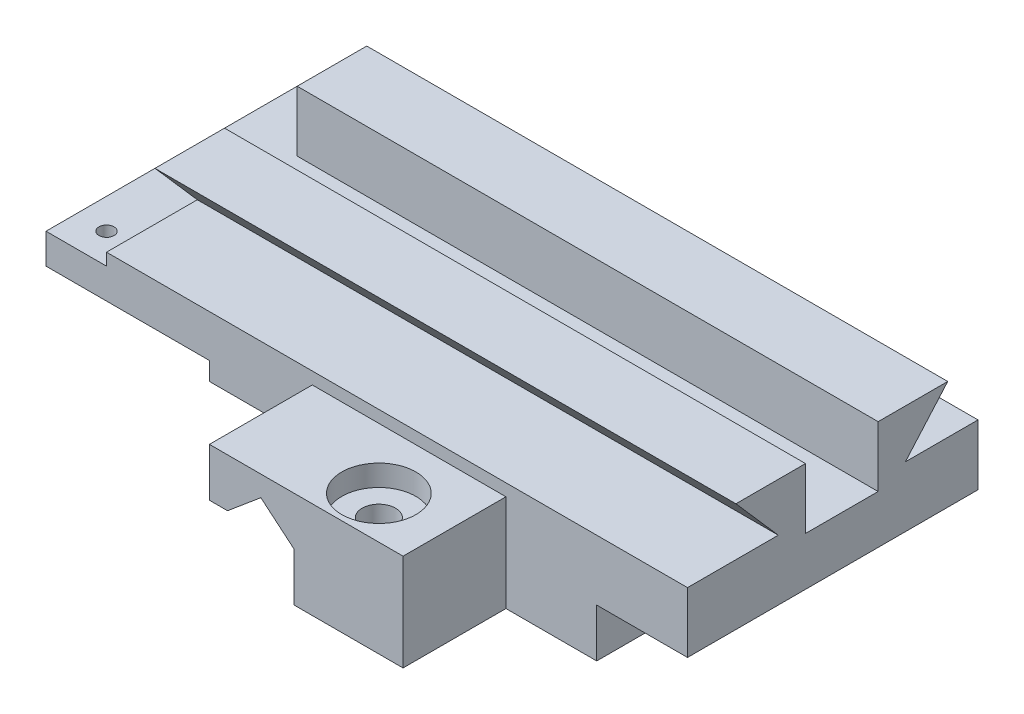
ISO-10303-21;
HEADER;
FILE_DESCRIPTION(('STEP AP214'),'2;1');
FILE_NAME('part.step','',(''),(''),'','','');
FILE_SCHEMA(('AUTOMOTIVE_DESIGN { 1 0 10303 214 1 1 1 1 }'));
ENDSEC;
DATA;
#1=APPLICATION_CONTEXT('core data for automotive mechanical design processes');
#2=APPLICATION_PROTOCOL_DEFINITION('international standard','automotive_design',2000,#1);
#3=PRODUCT_CONTEXT('',#1,'mechanical');
#4=PRODUCT('Part','Part','',(#3));
#5=PRODUCT_RELATED_PRODUCT_CATEGORY('part','',(#4));
#6=PRODUCT_DEFINITION_FORMATION('','',#4);
#7=PRODUCT_DEFINITION_CONTEXT('part definition',#1,'design');
#8=PRODUCT_DEFINITION('design','',#6,#7);
#9=PRODUCT_DEFINITION_SHAPE('','',#8);
#10=(LENGTH_UNIT() NAMED_UNIT(*) SI_UNIT(.MILLI.,.METRE.));
#11=(NAMED_UNIT(*) PLANE_ANGLE_UNIT() SI_UNIT($,.RADIAN.));
#12=(NAMED_UNIT(*) SI_UNIT($,.STERADIAN.) SOLID_ANGLE_UNIT());
#13=UNCERTAINTY_MEASURE_WITH_UNIT(LENGTH_MEASURE(1.E-05),#10,'distance_accuracy_value','');
#14=(GEOMETRIC_REPRESENTATION_CONTEXT(3) GLOBAL_UNCERTAINTY_ASSIGNED_CONTEXT((#13)) GLOBAL_UNIT_ASSIGNED_CONTEXT((#10,
#11,#12)) REPRESENTATION_CONTEXT('',''));
#15=CARTESIAN_POINT('',(0.,0.,0.));
#16=DIRECTION('',(0.,0.,1.));
#17=DIRECTION('',(1.,0.,0.));
#18=AXIS2_PLACEMENT_3D('',#15,#16,#17);
#19=CARTESIAN_POINT('',(10.,5.,65.));
#20=DIRECTION('',(1.,0.,0.));
#21=DIRECTION('',(0.,0.,-1.));
#22=AXIS2_PLACEMENT_3D('',#19,#20,#21);
#23=PLANE('',#22);
#24=DIRECTION('',(0.,1.,0.));
#25=VECTOR('',#24,1.);
#26=CARTESIAN_POINT('',(9.99999999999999,7.00000000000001,28.5));
#27=LINE('',#26,#25);
#28=CARTESIAN_POINT('',(10.,5.,28.5));
#29=VERTEX_POINT('',#28);
#30=CARTESIAN_POINT('',(9.99999999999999,15.,28.5));
#31=VERTEX_POINT('',#30);
#32=EDGE_CURVE('E274',#29,#31,#27,.T.);
#33=ORIENTED_EDGE('',*,*,#32,.F.);
#34=DIRECTION('',(0.,0.,-1.));
#35=VECTOR('',#34,1.);
#36=CARTESIAN_POINT('',(10.,5.,65.));
#37=LINE('',#36,#35);
#38=CARTESIAN_POINT('',(10.,5.,48.));
#39=VERTEX_POINT('',#38);
#40=EDGE_CURVE('E421',#39,#29,#37,.T.);
#41=ORIENTED_EDGE('',*,*,#40,.F.);
#42=DIRECTION('',(0.,1.,0.));
#43=VECTOR('',#42,1.);
#44=CARTESIAN_POINT('',(10.,5.,48.));
#45=LINE('',#44,#43);
#46=CARTESIAN_POINT('',(10.,7.,48.));
#47=VERTEX_POINT('',#46);
#48=EDGE_CURVE('E351',#39,#47,#45,.T.);
#49=ORIENTED_EDGE('',*,*,#48,.T.);
#50=DIRECTION('',(0.,0.,-1.));
#51=VECTOR('',#50,1.);
#52=CARTESIAN_POINT('',(10.,7.,65.));
#53=LINE('',#52,#51);
#54=CARTESIAN_POINT('',(9.99999999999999,7.00000000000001,33.));
#55=VERTEX_POINT('',#54);
#56=EDGE_CURVE('E425',#47,#55,#53,.T.);
#57=ORIENTED_EDGE('',*,*,#56,.T.);
#58=DIRECTION('',(0.,-0.752576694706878,-0.658504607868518));
#59=VECTOR('',#58,1.);
#60=CARTESIAN_POINT('',(9.99999999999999,15.,40.));
#61=LINE('',#60,#59);
#62=CARTESIAN_POINT('',(9.99999999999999,15.,40.));
#63=VERTEX_POINT('',#62);
#64=EDGE_CURVE('E281',#63,#55,#61,.T.);
#65=ORIENTED_EDGE('',*,*,#64,.F.);
#66=DIRECTION('',(0.,0.,1.));
#67=VECTOR('',#66,1.);
#68=CARTESIAN_POINT('',(9.99999999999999,15.,28.5));
#69=LINE('',#68,#67);
#70=EDGE_CURVE('E277',#31,#63,#69,.T.);
#71=ORIENTED_EDGE('',*,*,#70,.F.);
#72=EDGE_LOOP('',(#33,#41,#49,#57,#65,#71));
#73=FACE_BOUND('',#72,.T.);
#74=ADVANCED_FACE('F41',(#73),#23,.F.);
#75=CARTESIAN_POINT('',(106.,7.00000000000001,65.));
#76=DIRECTION('',(0.,-1.,0.));
#77=DIRECTION('',(1.,0.,0.));
#78=AXIS2_PLACEMENT_3D('',#75,#76,#77);
#79=PLANE('',#78);
#80=DIRECTION('',(1.,0.,0.));
#81=VECTOR('',#80,1.);
#82=CARTESIAN_POINT('',(9.99999999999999,7.00000000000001,33.));
#83=LINE('',#82,#81);
#84=CARTESIAN_POINT('',(106.,7.00000000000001,33.));
#85=VERTEX_POINT('',#84);
#86=EDGE_CURVE('E291',#55,#85,#83,.T.);
#87=ORIENTED_EDGE('',*,*,#86,.F.);
#88=ORIENTED_EDGE('',*,*,#56,.F.);
#89=DIRECTION('',(-1.,0.,0.));
#90=VECTOR('',#89,1.);
#91=CARTESIAN_POINT('',(44.,7.,48.));
#92=LINE('',#91,#90);
#93=CARTESIAN_POINT('',(106.,7.00000000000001,48.));
#94=VERTEX_POINT('',#93);
#95=EDGE_CURVE('E328',#94,#47,#92,.T.);
#96=ORIENTED_EDGE('',*,*,#95,.F.);
#97=DIRECTION('',(0.,0.,-1.));
#98=VECTOR('',#97,1.);
#99=CARTESIAN_POINT('',(106.,7.00000000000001,65.));
#100=LINE('',#99,#98);
#101=EDGE_CURVE('E429',#94,#85,#100,.T.);
#102=ORIENTED_EDGE('',*,*,#101,.T.);
#103=EDGE_LOOP('',(#87,#88,#96,#102));
#104=FACE_BOUND('',#103,.T.);
#105=ADVANCED_FACE('F524',(#104),#79,.F.);
#106=CARTESIAN_POINT('',(10.,7.,12.));
#107=VERTEX_POINT('',#106);
#108=CARTESIAN_POINT('',(10.,7.,0.));
#109=VERTEX_POINT('',#108);
#110=EDGE_CURVE('E424',#107,#109,#53,.T.);
#111=ORIENTED_EDGE('',*,*,#110,.F.);
#112=DIRECTION('',(1.,0.,0.));
#113=VECTOR('',#112,1.);
#114=CARTESIAN_POINT('',(9.99999999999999,7.00000000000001,12.));
#115=LINE('',#114,#113);
#116=CARTESIAN_POINT('',(106.,7.00000000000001,12.));
#117=VERTEX_POINT('',#116);
#118=EDGE_CURVE('E253',#107,#117,#115,.T.);
#119=ORIENTED_EDGE('',*,*,#118,.T.);
#120=CARTESIAN_POINT('',(106.,7.00000000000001,0.));
#121=VERTEX_POINT('',#120);
#122=EDGE_CURVE('E428',#117,#121,#100,.T.);
#123=ORIENTED_EDGE('',*,*,#122,.T.);
#124=DIRECTION('',(-1.,0.,0.));
#125=VECTOR('',#124,1.);
#126=CARTESIAN_POINT('',(106.,7.00000000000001,0.));
#127=LINE('',#126,#125);
#128=EDGE_CURVE('E411',#121,#109,#127,.T.);
#129=ORIENTED_EDGE('',*,*,#128,.T.);
#130=EDGE_LOOP('',(#111,#119,#123,#129));
#131=FACE_BOUND('',#130,.T.);
#132=ADVANCED_FACE('F550',(#131),#79,.F.);
#133=CARTESIAN_POINT('',(0.,5.,65.));
#134=DIRECTION('',(1.,0.,0.));
#135=DIRECTION('',(0.,1.,0.));
#136=AXIS2_PLACEMENT_3D('',#133,#134,#135);
#137=PLANE('',#136);
#138=DIRECTION('',(0.,0.,-1.));
#139=VECTOR('',#138,1.);
#140=CARTESIAN_POINT('',(0.,0.,65.));
#141=LINE('',#140,#139);
#142=CARTESIAN_POINT('',(0.,0.,48.));
#143=VERTEX_POINT('',#142);
#144=CARTESIAN_POINT('',(0.,0.,0.));
#145=VERTEX_POINT('',#144);
#146=EDGE_CURVE('E454',#143,#145,#141,.T.);
#147=ORIENTED_EDGE('',*,*,#146,.F.);
#148=DIRECTION('',(0.,1.,0.));
#149=VECTOR('',#148,1.);
#150=CARTESIAN_POINT('',(0.,-11.,48.));
#151=LINE('',#150,#149);
#152=CARTESIAN_POINT('',(0.,5.,48.));
#153=VERTEX_POINT('',#152);
#154=EDGE_CURVE('E332',#143,#153,#151,.T.);
#155=ORIENTED_EDGE('',*,*,#154,.T.);
#156=DIRECTION('',(0.,0.,-1.));
#157=VECTOR('',#156,1.);
#158=CARTESIAN_POINT('',(0.,5.,65.));
#159=LINE('',#158,#157);
#160=CARTESIAN_POINT('',(0.,5.,0.));
#161=VERTEX_POINT('',#160);
#162=EDGE_CURVE('E382',#153,#161,#159,.T.);
#163=ORIENTED_EDGE('',*,*,#162,.T.);
#164=DIRECTION('',(0.,-1.,0.));
#165=VECTOR('',#164,1.);
#166=CARTESIAN_POINT('',(0.,5.,0.));
#167=LINE('',#166,#165);
#168=EDGE_CURVE('E369',#161,#145,#167,.T.);
#169=ORIENTED_EDGE('',*,*,#168,.T.);
#170=EDGE_LOOP('',(#147,#155,#163,#169));
#171=FACE_BOUND('',#170,.T.);
#172=ADVANCED_FACE('F43',(#171),#137,.F.);
#173=CARTESIAN_POINT('',(0.,0.,65.));
#174=DIRECTION('',(0.,1.,0.));
#175=DIRECTION('',(0.,0.,1.));
#176=AXIS2_PLACEMENT_3D('',#173,#174,#175);
#177=PLANE('',#176);
#178=CARTESIAN_POINT('',(5.,0.,5.));
#179=DIRECTION('',(0.,1.,0.));
#180=DIRECTION('',(0.,0.,1.));
#181=AXIS2_PLACEMENT_3D('',#178,#179,#180);
#182=CIRCLE('',#181,1.25);
#183=CARTESIAN_POINT('',(5.,0.,6.25));
#184=VERTEX_POINT('',#183);
#185=EDGE_CURVE('E299',#184,#184,#182,.T.);
#186=ORIENTED_EDGE('',*,*,#185,.T.);
#187=EDGE_LOOP('',(#186));
#188=FACE_BOUND('',#187,.T.);
#189=CARTESIAN_POINT('',(5.,0.,43.));
#190=DIRECTION('',(0.,1.,0.));
#191=DIRECTION('',(0.,0.,1.));
#192=AXIS2_PLACEMENT_3D('',#189,#190,#191);
#193=CIRCLE('',#192,1.25);
#194=CARTESIAN_POINT('',(5.,0.,44.25));
#195=VERTEX_POINT('',#194);
#196=EDGE_CURVE('E45',#195,#195,#193,.T.);
#197=ORIENTED_EDGE('',*,*,#196,.T.);
#198=EDGE_LOOP('',(#197));
#199=FACE_BOUND('',#198,.T.);
#200=DIRECTION('',(0.,0.,-1.));
#201=VECTOR('',#200,1.);
#202=CARTESIAN_POINT('',(27.,0.,65.));
#203=LINE('',#202,#201);
#204=CARTESIAN_POINT('',(27.,0.,48.));
#205=VERTEX_POINT('',#204);
#206=CARTESIAN_POINT('',(27.,0.,0.));
#207=VERTEX_POINT('',#206);
#208=EDGE_CURVE('E452',#205,#207,#203,.T.);
#209=ORIENTED_EDGE('',*,*,#208,.F.);
#210=DIRECTION('',(-1.,0.,0.));
#211=VECTOR('',#210,1.);
#212=CARTESIAN_POINT('',(0.,0.,48.));
#213=LINE('',#212,#211);
#214=EDGE_CURVE('E360',#205,#143,#213,.T.);
#215=ORIENTED_EDGE('',*,*,#214,.T.);
#216=ORIENTED_EDGE('',*,*,#146,.T.);
#217=DIRECTION('',(1.,0.,0.));
#218=VECTOR('',#217,1.);
#219=CARTESIAN_POINT('',(0.,0.,0.));
#220=LINE('',#219,#218);
#221=EDGE_CURVE('E385',#145,#207,#220,.T.);
#222=ORIENTED_EDGE('',*,*,#221,.T.);
#223=EDGE_LOOP('',(#209,#215,#216,#222));
#224=FACE_BOUND('',#223,.T.);
#225=ADVANCED_FACE('F541',(#188,#199,#224),#177,.F.);
#226=CARTESIAN_POINT('',(27.,0.,65.));
#227=DIRECTION('',(1.,0.,0.));
#228=DIRECTION('',(0.,0.,-1.));
#229=AXIS2_PLACEMENT_3D('',#226,#227,#228);
#230=PLANE('',#229);
#231=DIRECTION('',(0.,0.,-1.));
#232=VECTOR('',#231,1.);
#233=CARTESIAN_POINT('',(27.,-3.,65.));
#234=LINE('',#233,#232);
#235=CARTESIAN_POINT('',(27.,-3.,48.));
#236=VERTEX_POINT('',#235);
#237=CARTESIAN_POINT('',(27.,-3.,0.));
#238=VERTEX_POINT('',#237);
#239=EDGE_CURVE('E450',#236,#238,#234,.T.);
#240=ORIENTED_EDGE('',*,*,#239,.F.);
#241=DIRECTION('',(0.,1.,0.));
#242=VECTOR('',#241,1.);
#243=CARTESIAN_POINT('',(27.,0.,48.));
#244=LINE('',#243,#242);
#245=EDGE_CURVE('E357',#236,#205,#244,.T.);
#246=ORIENTED_EDGE('',*,*,#245,.T.);
#247=ORIENTED_EDGE('',*,*,#208,.T.);
#248=DIRECTION('',(0.,-1.,0.));
#249=VECTOR('',#248,1.);
#250=CARTESIAN_POINT('',(27.,0.,0.));
#251=LINE('',#250,#249);
#252=EDGE_CURVE('E388',#207,#238,#251,.T.);
#253=ORIENTED_EDGE('',*,*,#252,.T.);
#254=EDGE_LOOP('',(#240,#246,#247,#253));
#255=FACE_BOUND('',#254,.T.);
#256=ADVANCED_FACE('F494',(#255),#230,.F.);
#257=CARTESIAN_POINT('',(27.,-3.,65.));
#258=DIRECTION('',(0.,1.,0.));
#259=DIRECTION('',(0.,0.,1.));
#260=AXIS2_PLACEMENT_3D('',#257,#258,#259);
#261=PLANE('',#260);
#262=CARTESIAN_POINT('',(34.,-3.,19.));
#263=DIRECTION('',(0.,-1.,0.));
#264=DIRECTION('',(0.,0.,-1.));
#265=AXIS2_PLACEMENT_3D('',#262,#263,#264);
#266=CIRCLE('',#265,1.64999999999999);
#267=CARTESIAN_POINT('',(34.,-3.,17.35));
#268=VERTEX_POINT('',#267);
#269=EDGE_CURVE('E233',#268,#268,#266,.T.);
#270=ORIENTED_EDGE('',*,*,#269,.F.);
#271=EDGE_LOOP('',(#270));
#272=FACE_BOUND('',#271,.T.);
#273=CARTESIAN_POINT('',(34.,-3.,31.));
#274=DIRECTION('',(0.,-1.,0.));
#275=DIRECTION('',(0.,0.,-1.));
#276=AXIS2_PLACEMENT_3D('',#273,#274,#275);
#277=CIRCLE('',#276,1.64999999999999);
#278=CARTESIAN_POINT('',(34.,-3.,29.35));
#279=VERTEX_POINT('',#278);
#280=EDGE_CURVE('E232',#279,#279,#277,.T.);
#281=ORIENTED_EDGE('',*,*,#280,.F.);
#282=EDGE_LOOP('',(#281));
#283=FACE_BOUND('',#282,.T.);
#284=DIRECTION('',(1.,0.,0.));
#285=VECTOR('',#284,1.);
#286=CARTESIAN_POINT('',(27.,-3.,65.));
#287=LINE('',#286,#285);
#288=CARTESIAN_POINT('',(44.,-3.,65.));
#289=VERTEX_POINT('',#288);
#290=CARTESIAN_POINT('',(47.,-3.,65.));
#291=VERTEX_POINT('',#290);
#292=EDGE_CURVE('E370',#289,#291,#287,.T.);
#293=ORIENTED_EDGE('',*,*,#292,.F.);
#294=DIRECTION('',(0.,0.,-1.));
#295=VECTOR('',#294,1.);
#296=CARTESIAN_POINT('',(44.,-3.,65.));
#297=LINE('',#296,#295);
#298=CARTESIAN_POINT('',(44.,-3.,48.));
#299=VERTEX_POINT('',#298);
#300=EDGE_CURVE('E65',#289,#299,#297,.T.);
#301=ORIENTED_EDGE('',*,*,#300,.T.);
#302=DIRECTION('',(-1.,0.,0.));
#303=VECTOR('',#302,1.);
#304=CARTESIAN_POINT('',(27.,-3.,48.));
#305=LINE('',#304,#303);
#306=EDGE_CURVE('E354',#299,#236,#305,.T.);
#307=ORIENTED_EDGE('',*,*,#306,.T.);
#308=ORIENTED_EDGE('',*,*,#239,.T.);
#309=DIRECTION('',(1.,0.,0.));
#310=VECTOR('',#309,1.);
#311=CARTESIAN_POINT('',(27.,-3.,0.));
#312=LINE('',#311,#310);
#313=CARTESIAN_POINT('',(47.,-3.,0.));
#314=VERTEX_POINT('',#313);
#315=EDGE_CURVE('E391',#238,#314,#312,.T.);
#316=ORIENTED_EDGE('',*,*,#315,.T.);
#317=DIRECTION('',(0.,0.,-1.));
#318=VECTOR('',#317,1.);
#319=CARTESIAN_POINT('',(47.,-3.,65.));
#320=LINE('',#319,#318);
#321=EDGE_CURVE('E447',#291,#314,#320,.T.);
#322=ORIENTED_EDGE('',*,*,#321,.F.);
#323=EDGE_LOOP('',(#293,#301,#307,#308,#316,#322));
#324=FACE_BOUND('',#323,.T.);
#325=ADVANCED_FACE('F464',(#272,#283,#324),#261,.F.);
#326=CARTESIAN_POINT('',(47.,-3.,65.));
#327=DIRECTION('',(-0.64278760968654,0.766044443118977,0.));
#328=DIRECTION('',(-0.766044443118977,-0.64278760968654,0.));
#329=AXIS2_PLACEMENT_3D('',#326,#327,#328);
#330=PLANE('',#329);
#331=DIRECTION('',(0.766044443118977,0.64278760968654,0.));
#332=VECTOR('',#331,1.);
#333=CARTESIAN_POINT('',(47.,-3.,0.));
#334=LINE('',#333,#332);
#335=CARTESIAN_POINT('',(52.5,1.61504797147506,0.));
#336=VERTEX_POINT('',#335);
#337=EDGE_CURVE('E393',#314,#336,#334,.T.);
#338=ORIENTED_EDGE('',*,*,#337,.T.);
#339=DIRECTION('',(0.,0.,-1.));
#340=VECTOR('',#339,1.);
#341=CARTESIAN_POINT('',(52.5,1.61504797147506,65.));
#342=LINE('',#341,#340);
#343=CARTESIAN_POINT('',(52.5,1.61504797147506,65.));
#344=VERTEX_POINT('',#343);
#345=EDGE_CURVE('E444',#344,#336,#342,.T.);
#346=ORIENTED_EDGE('',*,*,#345,.F.);
#347=DIRECTION('',(0.766044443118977,0.64278760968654,0.));
#348=VECTOR('',#347,1.);
#349=CARTESIAN_POINT('',(47.,-3.,65.));
#350=LINE('',#349,#348);
#351=EDGE_CURVE('E372',#291,#344,#350,.T.);
#352=ORIENTED_EDGE('',*,*,#351,.F.);
#353=ORIENTED_EDGE('',*,*,#321,.T.);
#354=EDGE_LOOP('',(#338,#346,#352,#353));
#355=FACE_BOUND('',#354,.T.);
#356=ADVANCED_FACE('F470',(#355),#330,.F.);
#357=CARTESIAN_POINT('',(52.5,1.61504797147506,65.));
#358=DIRECTION('',(0.64278760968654,0.766044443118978,0.));
#359=DIRECTION('',(-0.766044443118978,0.64278760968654,0.));
#360=AXIS2_PLACEMENT_3D('',#357,#358,#359);
#361=PLANE('',#360);
#362=DIRECTION('',(0.766044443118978,-0.64278760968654,0.));
#363=VECTOR('',#362,1.);
#364=CARTESIAN_POINT('',(52.5,1.61504797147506,0.));
#365=LINE('',#364,#363);
#366=CARTESIAN_POINT('',(58.,-2.99999999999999,0.));
#367=VERTEX_POINT('',#366);
#368=EDGE_CURVE('E395',#336,#367,#365,.T.);
#369=ORIENTED_EDGE('',*,*,#368,.T.);
#370=DIRECTION('',(0.,0.,-1.));
#371=VECTOR('',#370,1.);
#372=CARTESIAN_POINT('',(58.,-2.99999999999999,65.));
#373=LINE('',#372,#371);
#374=CARTESIAN_POINT('',(58.,-2.99999999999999,65.));
#375=VERTEX_POINT('',#374);
#376=EDGE_CURVE('E441',#375,#367,#373,.T.);
#377=ORIENTED_EDGE('',*,*,#376,.F.);
#378=DIRECTION('',(0.766044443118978,-0.64278760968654,0.));
#379=VECTOR('',#378,1.);
#380=CARTESIAN_POINT('',(52.5,1.61504797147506,65.));
#381=LINE('',#380,#379);
#382=EDGE_CURVE('E375',#344,#375,#381,.T.);
#383=ORIENTED_EDGE('',*,*,#382,.F.);
#384=ORIENTED_EDGE('',*,*,#345,.T.);
#385=EDGE_LOOP('',(#369,#377,#383,#384));
#386=FACE_BOUND('',#385,.T.);
#387=ADVANCED_FACE('F476',(#386),#361,.F.);
#388=CARTESIAN_POINT('',(58.,-2.99999999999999,65.));
#389=DIRECTION('',(1.,0.,0.));
#390=DIRECTION('',(0.,0.,-1.));
#391=AXIS2_PLACEMENT_3D('',#388,#389,#390);
#392=PLANE('',#391);
#393=DIRECTION('',(0.,-1.,0.));
#394=VECTOR('',#393,1.);
#395=CARTESIAN_POINT('',(58.,-2.99999999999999,0.));
#396=LINE('',#395,#394);
#397=CARTESIAN_POINT('',(58.,-11.,0.));
#398=VERTEX_POINT('',#397);
#399=EDGE_CURVE('E397',#367,#398,#396,.T.);
#400=ORIENTED_EDGE('',*,*,#399,.T.);
#401=DIRECTION('',(0.,0.,-1.));
#402=VECTOR('',#401,1.);
#403=CARTESIAN_POINT('',(58.,-11.,65.));
#404=LINE('',#403,#402);
#405=CARTESIAN_POINT('',(58.,-11.,65.));
#406=VERTEX_POINT('',#405);
#407=EDGE_CURVE('E438',#406,#398,#404,.T.);
#408=ORIENTED_EDGE('',*,*,#407,.F.);
#409=DIRECTION('',(0.,-1.,0.));
#410=VECTOR('',#409,1.);
#411=CARTESIAN_POINT('',(58.,-2.99999999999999,65.));
#412=LINE('',#411,#410);
#413=EDGE_CURVE('E377',#375,#406,#412,.T.);
#414=ORIENTED_EDGE('',*,*,#413,.F.);
#415=ORIENTED_EDGE('',*,*,#376,.T.);
#416=EDGE_LOOP('',(#400,#408,#414,#415));
#417=FACE_BOUND('',#416,.T.);
#418=ADVANCED_FACE('F480',(#417),#392,.F.);
#419=CARTESIAN_POINT('',(58.,-11.,65.));
#420=DIRECTION('',(0.,1.,0.));
#421=DIRECTION('',(-1.,0.,0.));
#422=AXIS2_PLACEMENT_3D('',#419,#420,#421);
#423=PLANE('',#422);
#424=CARTESIAN_POINT('',(65.,-11.,58.));
#425=DIRECTION('',(0.,1.,0.));
#426=DIRECTION('',(0.,0.,1.));
#427=AXIS2_PLACEMENT_3D('',#424,#425,#426);
#428=CIRCLE('',#427,2.75);
#429=CARTESIAN_POINT('',(65.,-11.,60.75));
#430=VERTEX_POINT('',#429);
#431=EDGE_CURVE('E314',#430,#430,#428,.T.);
#432=ORIENTED_EDGE('',*,*,#431,.T.);
#433=EDGE_LOOP('',(#432));
#434=FACE_BOUND('',#433,.T.);
#435=DIRECTION('',(-1.,0.,0.));
#436=VECTOR('',#435,1.);
#437=CARTESIAN_POINT('',(76.,-11.,48.));
#438=LINE('',#437,#436);
#439=CARTESIAN_POINT('',(91.,-11.,48.));
#440=VERTEX_POINT('',#439);
#441=CARTESIAN_POINT('',(76.,-11.,48.));
#442=VERTEX_POINT('',#441);
#443=EDGE_CURVE('E340',#440,#442,#438,.T.);
#444=ORIENTED_EDGE('',*,*,#443,.T.);
#445=DIRECTION('',(0.,0.,1.));
#446=VECTOR('',#445,1.);
#447=CARTESIAN_POINT('',(76.,-11.,65.));
#448=LINE('',#447,#446);
#449=CARTESIAN_POINT('',(76.,-11.,65.));
#450=VERTEX_POINT('',#449);
#451=EDGE_CURVE('E331',#442,#450,#448,.T.);
#452=ORIENTED_EDGE('',*,*,#451,.T.);
#453=DIRECTION('',(1.,0.,0.));
#454=VECTOR('',#453,1.);
#455=CARTESIAN_POINT('',(58.,-11.,65.));
#456=LINE('',#455,#454);
#457=EDGE_CURVE('E379',#406,#450,#456,.T.);
#458=ORIENTED_EDGE('',*,*,#457,.F.);
#459=ORIENTED_EDGE('',*,*,#407,.T.);
#460=DIRECTION('',(1.,0.,0.));
#461=VECTOR('',#460,1.);
#462=CARTESIAN_POINT('',(58.,-11.,0.));
#463=LINE('',#462,#461);
#464=CARTESIAN_POINT('',(91.,-11.,0.));
#465=VERTEX_POINT('',#464);
#466=EDGE_CURVE('E399',#398,#465,#463,.T.);
#467=ORIENTED_EDGE('',*,*,#466,.T.);
#468=DIRECTION('',(0.,0.,-1.));
#469=VECTOR('',#468,1.);
#470=CARTESIAN_POINT('',(91.,-11.,65.));
#471=LINE('',#470,#469);
#472=EDGE_CURVE('E436',#440,#465,#471,.T.);
#473=ORIENTED_EDGE('',*,*,#472,.F.);
#474=EDGE_LOOP('',(#444,#452,#458,#459,#467,#473));
#475=FACE_BOUND('',#474,.T.);
#476=ADVANCED_FACE('F484',(#434,#475),#423,.F.);
#477=CARTESIAN_POINT('',(91.,-11.,65.));
#478=DIRECTION('',(-1.,0.,0.));
#479=DIRECTION('',(0.,0.,1.));
#480=AXIS2_PLACEMENT_3D('',#477,#478,#479);
#481=PLANE('',#480);
#482=DIRECTION('',(0.,0.,-1.));
#483=VECTOR('',#482,1.);
#484=CARTESIAN_POINT('',(91.,-2.99999999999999,65.));
#485=LINE('',#484,#483);
#486=CARTESIAN_POINT('',(91.,-2.99999999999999,48.));
#487=VERTEX_POINT('',#486);
#488=CARTESIAN_POINT('',(91.,-2.99999999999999,0.));
#489=VERTEX_POINT('',#488);
#490=EDGE_CURVE('E434',#487,#489,#485,.T.);
#491=ORIENTED_EDGE('',*,*,#490,.F.);
#492=DIRECTION('',(0.,-1.,0.));
#493=VECTOR('',#492,1.);
#494=CARTESIAN_POINT('',(91.,-11.,48.));
#495=LINE('',#494,#493);
#496=EDGE_CURVE('E366',#487,#440,#495,.T.);
#497=ORIENTED_EDGE('',*,*,#496,.T.);
#498=ORIENTED_EDGE('',*,*,#472,.T.);
#499=DIRECTION('',(0.,1.,0.));
#500=VECTOR('',#499,1.);
#501=CARTESIAN_POINT('',(91.,-11.,0.));
#502=LINE('',#501,#500);
#503=EDGE_CURVE('E402',#465,#489,#502,.T.);
#504=ORIENTED_EDGE('',*,*,#503,.T.);
#505=EDGE_LOOP('',(#491,#497,#498,#504));
#506=FACE_BOUND('',#505,.T.);
#507=ADVANCED_FACE('F506',(#506),#481,.F.);
#508=CARTESIAN_POINT('',(91.,-2.99999999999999,65.));
#509=DIRECTION('',(0.,1.,0.));
#510=DIRECTION('',(0.,0.,1.));
#511=AXIS2_PLACEMENT_3D('',#508,#509,#510);
#512=PLANE('',#511);
#513=DIRECTION('',(0.,0.,-1.));
#514=VECTOR('',#513,1.);
#515=CARTESIAN_POINT('',(106.,-2.99999999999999,65.));
#516=LINE('',#515,#514);
#517=CARTESIAN_POINT('',(106.,-2.99999999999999,48.));
#518=VERTEX_POINT('',#517);
#519=CARTESIAN_POINT('',(106.,-2.99999999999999,0.));
#520=VERTEX_POINT('',#519);
#521=EDGE_CURVE('E432',#518,#520,#516,.T.);
#522=ORIENTED_EDGE('',*,*,#521,.F.);
#523=DIRECTION('',(-1.,0.,0.));
#524=VECTOR('',#523,1.);
#525=CARTESIAN_POINT('',(91.,-2.99999999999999,48.));
#526=LINE('',#525,#524);
#527=EDGE_CURVE('E363',#518,#487,#526,.T.);
#528=ORIENTED_EDGE('',*,*,#527,.T.);
#529=ORIENTED_EDGE('',*,*,#490,.T.);
#530=DIRECTION('',(1.,0.,0.));
#531=VECTOR('',#530,1.);
#532=CARTESIAN_POINT('',(91.,-2.99999999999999,0.));
#533=LINE('',#532,#531);
#534=EDGE_CURVE('E405',#489,#520,#533,.T.);
#535=ORIENTED_EDGE('',*,*,#534,.T.);
#536=EDGE_LOOP('',(#522,#528,#529,#535));
#537=FACE_BOUND('',#536,.T.);
#538=ADVANCED_FACE('F510',(#537),#512,.F.);
#539=CARTESIAN_POINT('',(106.,-2.99999999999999,65.));
#540=DIRECTION('',(-1.,0.,0.));
#541=DIRECTION('',(0.,0.,1.));
#542=AXIS2_PLACEMENT_3D('',#539,#540,#541);
#543=PLANE('',#542);
#544=DIRECTION('',(0.,0.,-1.));
#545=VECTOR('',#544,1.);
#546=CARTESIAN_POINT('',(106.,5.00000000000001,28.5));
#547=LINE('',#546,#545);
#548=CARTESIAN_POINT('',(106.,5.00000000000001,28.5));
#549=VERTEX_POINT('',#548);
#550=CARTESIAN_POINT('',(106.,5.00000000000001,16.5));
#551=VERTEX_POINT('',#550);
#552=EDGE_CURVE('E243',#549,#551,#547,.T.);
#553=ORIENTED_EDGE('',*,*,#552,.F.);
#554=DIRECTION('',(0.,1.,0.));
#555=VECTOR('',#554,1.);
#556=CARTESIAN_POINT('',(106.,7.00000000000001,28.5));
#557=LINE('',#556,#555);
#558=CARTESIAN_POINT('',(106.,15.,28.5));
#559=VERTEX_POINT('',#558);
#560=EDGE_CURVE('E268',#549,#559,#557,.T.);
#561=ORIENTED_EDGE('',*,*,#560,.T.);
#562=DIRECTION('',(0.,0.,1.));
#563=VECTOR('',#562,1.);
#564=CARTESIAN_POINT('',(106.,15.,28.5));
#565=LINE('',#564,#563);
#566=CARTESIAN_POINT('',(106.,15.,40.));
#567=VERTEX_POINT('',#566);
#568=EDGE_CURVE('E286',#559,#567,#565,.T.);
#569=ORIENTED_EDGE('',*,*,#568,.T.);
#570=DIRECTION('',(0.,-0.752576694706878,-0.658504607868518));
#571=VECTOR('',#570,1.);
#572=CARTESIAN_POINT('',(106.,15.,40.));
#573=LINE('',#572,#571);
#574=EDGE_CURVE('E278',#567,#85,#573,.T.);
#575=ORIENTED_EDGE('',*,*,#574,.T.);
#576=ORIENTED_EDGE('',*,*,#101,.F.);
#577=DIRECTION('',(0.,1.,0.));
#578=VECTOR('',#577,1.);
#579=CARTESIAN_POINT('',(106.,-11.,48.));
#580=LINE('',#579,#578);
#581=EDGE_CURVE('E341',#518,#94,#580,.T.);
#582=ORIENTED_EDGE('',*,*,#581,.F.);
#583=ORIENTED_EDGE('',*,*,#521,.T.);
#584=DIRECTION('',(0.,1.,0.));
#585=VECTOR('',#584,1.);
#586=CARTESIAN_POINT('',(106.,-2.99999999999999,0.));
#587=LINE('',#586,#585);
#588=EDGE_CURVE('E408',#520,#121,#587,.T.);
#589=ORIENTED_EDGE('',*,*,#588,.T.);
#590=ORIENTED_EDGE('',*,*,#122,.F.);
#591=DIRECTION('',(0.,0.752576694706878,-0.658504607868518));
#592=VECTOR('',#591,1.);
#593=CARTESIAN_POINT('',(106.,15.,5.));
#594=LINE('',#593,#592);
#595=CARTESIAN_POINT('',(106.,15.,5.));
#596=VERTEX_POINT('',#595);
#597=EDGE_CURVE('E265',#117,#596,#594,.T.);
#598=ORIENTED_EDGE('',*,*,#597,.T.);
#599=DIRECTION('',(0.,0.,1.));
#600=VECTOR('',#599,1.);
#601=CARTESIAN_POINT('',(106.,15.,16.5));
#602=LINE('',#601,#600);
#603=CARTESIAN_POINT('',(106.,15.,16.5));
#604=VERTEX_POINT('',#603);
#605=EDGE_CURVE('E262',#596,#604,#602,.T.);
#606=ORIENTED_EDGE('',*,*,#605,.T.);
#607=DIRECTION('',(0.,-1.,0.));
#608=VECTOR('',#607,1.);
#609=CARTESIAN_POINT('',(106.,7.00000000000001,16.5));
#610=LINE('',#609,#608);
#611=EDGE_CURVE('E260',#604,#551,#610,.T.);
#612=ORIENTED_EDGE('',*,*,#611,.T.);
#613=EDGE_LOOP('',(#553,#561,#569,#575,#576,#582,#583,#589,#590,#598,#606,#612));
#614=FACE_BOUND('',#613,.T.);
#615=ADVANCED_FACE('F514',(#614),#543,.F.);
#616=CARTESIAN_POINT('',(10.,5.00000000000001,16.5));
#617=VERTEX_POINT('',#616);
#618=CARTESIAN_POINT('',(10.,5.,0.));
#619=VERTEX_POINT('',#618);
#620=EDGE_CURVE('E420',#617,#619,#37,.T.);
#621=ORIENTED_EDGE('',*,*,#620,.F.);
#622=DIRECTION('',(0.,-1.,0.));
#623=VECTOR('',#622,1.);
#624=CARTESIAN_POINT('',(9.99999999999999,7.00000000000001,16.5));
#625=LINE('',#624,#623);
#626=CARTESIAN_POINT('',(9.99999999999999,15.,16.5));
#627=VERTEX_POINT('',#626);
#628=EDGE_CURVE('E256',#627,#617,#625,.T.);
#629=ORIENTED_EDGE('',*,*,#628,.F.);
#630=DIRECTION('',(0.,0.,1.));
#631=VECTOR('',#630,1.);
#632=CARTESIAN_POINT('',(9.99999999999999,15.,16.5));
#633=LINE('',#632,#631);
#634=CARTESIAN_POINT('',(9.99999999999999,15.,5.));
#635=VERTEX_POINT('',#634);
#636=EDGE_CURVE('E270',#635,#627,#633,.T.);
#637=ORIENTED_EDGE('',*,*,#636,.F.);
#638=DIRECTION('',(0.,0.752576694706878,-0.658504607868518));
#639=VECTOR('',#638,1.);
#640=CARTESIAN_POINT('',(9.99999999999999,15.,5.));
#641=LINE('',#640,#639);
#642=EDGE_CURVE('E57',#107,#635,#641,.T.);
#643=ORIENTED_EDGE('',*,*,#642,.F.);
#644=ORIENTED_EDGE('',*,*,#110,.T.);
#645=DIRECTION('',(0.,-1.,0.));
#646=VECTOR('',#645,1.);
#647=CARTESIAN_POINT('',(10.,5.,0.));
#648=LINE('',#647,#646);
#649=EDGE_CURVE('E414',#109,#619,#648,.T.);
#650=ORIENTED_EDGE('',*,*,#649,.T.);
#651=EDGE_LOOP('',(#621,#629,#637,#643,#644,#650));
#652=FACE_BOUND('',#651,.T.);
#653=ADVANCED_FACE('F547',(#652),#23,.F.);
#654=CARTESIAN_POINT('',(0.,5.,65.));
#655=DIRECTION('',(0.,-1.,0.));
#656=DIRECTION('',(1.,0.,0.));
#657=AXIS2_PLACEMENT_3D('',#654,#655,#656);
#658=PLANE('',#657);
#659=CARTESIAN_POINT('',(5.,5.,5.));
#660=DIRECTION('',(0.,1.,0.));
#661=DIRECTION('',(0.,0.,1.));
#662=AXIS2_PLACEMENT_3D('',#659,#660,#661);
#663=CIRCLE('',#662,1.25);
#664=CARTESIAN_POINT('',(5.,5.,6.25));
#665=VERTEX_POINT('',#664);
#666=EDGE_CURVE('E293',#665,#665,#663,.T.);
#667=ORIENTED_EDGE('',*,*,#666,.F.);
#668=EDGE_LOOP('',(#667));
#669=FACE_BOUND('',#668,.T.);
#670=CARTESIAN_POINT('',(5.,5.,43.));
#671=DIRECTION('',(0.,1.,0.));
#672=DIRECTION('',(0.,0.,1.));
#673=AXIS2_PLACEMENT_3D('',#670,#671,#672);
#674=CIRCLE('',#673,1.25);
#675=CARTESIAN_POINT('',(5.,5.,44.25));
#676=VERTEX_POINT('',#675);
#677=EDGE_CURVE('E302',#676,#676,#674,.T.);
#678=ORIENTED_EDGE('',*,*,#677,.F.);
#679=EDGE_LOOP('',(#678));
#680=FACE_BOUND('',#679,.T.);
#681=ORIENTED_EDGE('',*,*,#162,.F.);
#682=DIRECTION('',(1.,0.,0.));
#683=VECTOR('',#682,1.);
#684=CARTESIAN_POINT('',(0.,5.,48.));
#685=LINE('',#684,#683);
#686=EDGE_CURVE('E11',#153,#39,#685,.T.);
#687=ORIENTED_EDGE('',*,*,#686,.T.);
#688=ORIENTED_EDGE('',*,*,#40,.T.);
#689=DIRECTION('',(1.,0.,0.));
#690=VECTOR('',#689,1.);
#691=CARTESIAN_POINT('',(-0.001000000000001,5.00000000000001,28.5));
#692=LINE('',#691,#690);
#693=EDGE_CURVE('E246',#29,#549,#692,.T.);
#694=ORIENTED_EDGE('',*,*,#693,.T.);
#695=ORIENTED_EDGE('',*,*,#552,.T.);
#696=DIRECTION('',(1.,0.,0.));
#697=VECTOR('',#696,1.);
#698=CARTESIAN_POINT('',(-0.001000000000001,5.00000000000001,16.5));
#699=LINE('',#698,#697);
#700=EDGE_CURVE('E247',#617,#551,#699,.T.);
#701=ORIENTED_EDGE('',*,*,#700,.F.);
#702=ORIENTED_EDGE('',*,*,#620,.T.);
#703=DIRECTION('',(-1.,0.,0.));
#704=VECTOR('',#703,1.);
#705=CARTESIAN_POINT('',(0.,5.,0.));
#706=LINE('',#705,#704);
#707=EDGE_CURVE('E373',#619,#161,#706,.T.);
#708=ORIENTED_EDGE('',*,*,#707,.T.);
#709=EDGE_LOOP('',(#681,#687,#688,#694,#695,#701,#702,#708));
#710=FACE_BOUND('',#709,.T.);
#711=ADVANCED_FACE('F537',(#669,#680,#710),#658,.F.);
#712=CARTESIAN_POINT('',(0.,0.,65.));
#713=DIRECTION('',(0.,0.,1.));
#714=DIRECTION('',(1.,0.,0.));
#715=AXIS2_PLACEMENT_3D('',#712,#713,#714);
#716=PLANE('',#715);
#717=DIRECTION('',(1.,0.,0.));
#718=VECTOR('',#717,1.);
#719=CARTESIAN_POINT('',(44.,5.,65.));
#720=LINE('',#719,#718);
#721=CARTESIAN_POINT('',(44.,5.,65.));
#722=VERTEX_POINT('',#721);
#723=CARTESIAN_POINT('',(76.,5.,65.));
#724=VERTEX_POINT('',#723);
#725=EDGE_CURVE('E317',#722,#724,#720,.T.);
#726=ORIENTED_EDGE('',*,*,#725,.F.);
#727=DIRECTION('',(0.,1.,0.));
#728=VECTOR('',#727,1.);
#729=CARTESIAN_POINT('',(44.,0.,65.));
#730=LINE('',#729,#728);
#731=EDGE_CURVE('E50',#289,#722,#730,.T.);
#732=ORIENTED_EDGE('',*,*,#731,.F.);
#733=ORIENTED_EDGE('',*,*,#292,.T.);
#734=ORIENTED_EDGE('',*,*,#351,.T.);
#735=ORIENTED_EDGE('',*,*,#382,.T.);
#736=ORIENTED_EDGE('',*,*,#413,.T.);
#737=ORIENTED_EDGE('',*,*,#457,.T.);
#738=DIRECTION('',(0.,1.,0.));
#739=VECTOR('',#738,1.);
#740=CARTESIAN_POINT('',(76.,-11.,65.));
#741=LINE('',#740,#739);
#742=EDGE_CURVE('E337',#450,#724,#741,.T.);
#743=ORIENTED_EDGE('',*,*,#742,.T.);
#744=EDGE_LOOP('',(#726,#732,#733,#734,#735,#736,#737,#743));
#745=FACE_BOUND('',#744,.T.);
#746=ADVANCED_FACE('F461',(#745),#716,.T.);
#747=CARTESIAN_POINT('',(0.,0.,0.));
#748=DIRECTION('',(0.,0.,1.));
#749=DIRECTION('',(1.,0.,0.));
#750=AXIS2_PLACEMENT_3D('',#747,#748,#749);
#751=PLANE('',#750);
#752=ORIENTED_EDGE('',*,*,#168,.F.);
#753=ORIENTED_EDGE('',*,*,#707,.F.);
#754=ORIENTED_EDGE('',*,*,#649,.F.);
#755=ORIENTED_EDGE('',*,*,#128,.F.);
#756=ORIENTED_EDGE('',*,*,#588,.F.);
#757=ORIENTED_EDGE('',*,*,#534,.F.);
#758=ORIENTED_EDGE('',*,*,#503,.F.);
#759=ORIENTED_EDGE('',*,*,#466,.F.);
#760=ORIENTED_EDGE('',*,*,#399,.F.);
#761=ORIENTED_EDGE('',*,*,#368,.F.);
#762=ORIENTED_EDGE('',*,*,#337,.F.);
#763=ORIENTED_EDGE('',*,*,#315,.F.);
#764=ORIENTED_EDGE('',*,*,#252,.F.);
#765=ORIENTED_EDGE('',*,*,#221,.F.);
#766=EDGE_LOOP('',(#752,#753,#754,#755,#756,#757,#758,#759,#760,#761,#762,#763,#764,#765));
#767=FACE_BOUND('',#766,.T.);
#768=ADVANCED_FACE('F500',(#767),#751,.F.);
#769=CARTESIAN_POINT('',(76.,-11.,65.));
#770=DIRECTION('',(-1.,0.,0.));
#771=DIRECTION('',(0.,-1.,0.));
#772=AXIS2_PLACEMENT_3D('',#769,#770,#771);
#773=PLANE('',#772);
#774=DIRECTION('',(0.,1.,0.));
#775=VECTOR('',#774,1.);
#776=CARTESIAN_POINT('',(76.,-11.,48.));
#777=LINE('',#776,#775);
#778=CARTESIAN_POINT('',(76.,5.,48.));
#779=VERTEX_POINT('',#778);
#780=EDGE_CURVE('E326',#442,#779,#777,.T.);
#781=ORIENTED_EDGE('',*,*,#780,.T.);
#782=DIRECTION('',(0.,0.,1.));
#783=VECTOR('',#782,1.);
#784=CARTESIAN_POINT('',(76.,5.,48.));
#785=LINE('',#784,#783);
#786=EDGE_CURVE('E323',#779,#724,#785,.T.);
#787=ORIENTED_EDGE('',*,*,#786,.T.);
#788=ORIENTED_EDGE('',*,*,#742,.F.);
#789=ORIENTED_EDGE('',*,*,#451,.F.);
#790=EDGE_LOOP('',(#781,#787,#788,#789));
#791=FACE_BOUND('',#790,.T.);
#792=ADVANCED_FACE('F487',(#791),#773,.F.);
#793=CARTESIAN_POINT('',(44.,-11.,48.));
#794=DIRECTION('',(0.,0.,-1.));
#795=DIRECTION('',(-1.,0.,0.));
#796=AXIS2_PLACEMENT_3D('',#793,#794,#795);
#797=PLANE('',#796);
#798=ORIENTED_EDGE('',*,*,#245,.F.);
#799=ORIENTED_EDGE('',*,*,#306,.F.);
#800=DIRECTION('',(0.,1.,0.));
#801=VECTOR('',#800,1.);
#802=CARTESIAN_POINT('',(44.,-11.,48.));
#803=LINE('',#802,#801);
#804=CARTESIAN_POINT('',(44.,5.,48.));
#805=VERTEX_POINT('',#804);
#806=EDGE_CURVE('E330',#299,#805,#803,.T.);
#807=ORIENTED_EDGE('',*,*,#806,.T.);
#808=DIRECTION('',(1.,0.,0.));
#809=VECTOR('',#808,1.);
#810=CARTESIAN_POINT('',(44.,5.,48.));
#811=LINE('',#810,#809);
#812=EDGE_CURVE('E318',#805,#779,#811,.T.);
#813=ORIENTED_EDGE('',*,*,#812,.T.);
#814=ORIENTED_EDGE('',*,*,#780,.F.);
#815=ORIENTED_EDGE('',*,*,#443,.F.);
#816=ORIENTED_EDGE('',*,*,#496,.F.);
#817=ORIENTED_EDGE('',*,*,#527,.F.);
#818=ORIENTED_EDGE('',*,*,#581,.T.);
#819=ORIENTED_EDGE('',*,*,#95,.T.);
#820=ORIENTED_EDGE('',*,*,#48,.F.);
#821=ORIENTED_EDGE('',*,*,#686,.F.);
#822=ORIENTED_EDGE('',*,*,#154,.F.);
#823=ORIENTED_EDGE('',*,*,#214,.F.);
#824=EDGE_LOOP('',(#798,#799,#807,#813,#814,#815,#816,#817,#818,#819,#820,#821,#822,#823));
#825=FACE_BOUND('',#824,.T.);
#826=ADVANCED_FACE('F491',(#825),#797,.F.);
#827=CARTESIAN_POINT('',(44.,-11.,65.));
#828=DIRECTION('',(1.,0.,0.));
#829=DIRECTION('',(0.,1.,0.));
#830=AXIS2_PLACEMENT_3D('',#827,#828,#829);
#831=PLANE('',#830);
#832=ORIENTED_EDGE('',*,*,#731,.T.);
#833=DIRECTION('',(0.,0.,1.));
#834=VECTOR('',#833,1.);
#835=CARTESIAN_POINT('',(44.,5.,48.));
#836=LINE('',#835,#834);
#837=EDGE_CURVE('E321',#805,#722,#836,.T.);
#838=ORIENTED_EDGE('',*,*,#837,.F.);
#839=ORIENTED_EDGE('',*,*,#806,.F.);
#840=ORIENTED_EDGE('',*,*,#300,.F.);
#841=EDGE_LOOP('',(#832,#838,#839,#840));
#842=FACE_BOUND('',#841,.T.);
#843=ADVANCED_FACE('F457',(#842),#831,.F.);
#844=CARTESIAN_POINT('',(44.,5.,48.));
#845=DIRECTION('',(0.,-1.,0.));
#846=DIRECTION('',(0.,0.,-1.));
#847=AXIS2_PLACEMENT_3D('',#844,#845,#846);
#848=PLANE('',#847);
#849=CARTESIAN_POINT('',(65.,5.,58.));
#850=DIRECTION('',(0.,1.,0.));
#851=DIRECTION('',(0.,0.,1.));
#852=AXIS2_PLACEMENT_3D('',#849,#850,#851);
#853=CIRCLE('',#852,6.119);
#854=CARTESIAN_POINT('',(65.,5.,64.119));
#855=VERTEX_POINT('',#854);
#856=EDGE_CURVE('E305',#855,#855,#853,.T.);
#857=ORIENTED_EDGE('',*,*,#856,.F.);
#858=EDGE_LOOP('',(#857));
#859=FACE_BOUND('',#858,.T.);
#860=ORIENTED_EDGE('',*,*,#725,.T.);
#861=ORIENTED_EDGE('',*,*,#786,.F.);
#862=ORIENTED_EDGE('',*,*,#812,.F.);
#863=ORIENTED_EDGE('',*,*,#837,.T.);
#864=EDGE_LOOP('',(#860,#861,#862,#863));
#865=FACE_BOUND('',#864,.T.);
#866=ADVANCED_FACE('F489',(#859,#865),#848,.F.);
#867=CARTESIAN_POINT('',(65.,5.,58.));
#868=DIRECTION('',(0.,1.,0.));
#869=DIRECTION('',(0.,0.,1.));
#870=AXIS2_PLACEMENT_3D('',#867,#868,#869);
#871=CYLINDRICAL_SURFACE('',#870,2.75);
#872=ORIENTED_EDGE('',*,*,#431,.F.);
#873=EDGE_LOOP('',(#872));
#874=FACE_BOUND('',#873,.T.);
#875=CARTESIAN_POINT('',(65.,1.5,58.));
#876=DIRECTION('',(0.,1.,0.));
#877=DIRECTION('',(0.,0.,1.));
#878=AXIS2_PLACEMENT_3D('',#875,#876,#877);
#879=CIRCLE('',#878,2.75);
#880=CARTESIAN_POINT('',(65.,1.5,60.75));
#881=VERTEX_POINT('',#880);
#882=EDGE_CURVE('E311',#881,#881,#879,.T.);
#883=ORIENTED_EDGE('',*,*,#882,.T.);
#884=EDGE_LOOP('',(#883));
#885=FACE_BOUND('',#884,.T.);
#886=ADVANCED_FACE('F630',(#874,#885),#871,.F.);
#887=CARTESIAN_POINT('',(67.75,1.5,58.));
#888=DIRECTION('',(0.,-1.,0.));
#889=DIRECTION('',(0.,0.,-1.));
#890=AXIS2_PLACEMENT_3D('',#887,#888,#889);
#891=PLANE('',#890);
#892=ORIENTED_EDGE('',*,*,#882,.F.);
#893=EDGE_LOOP('',(#892));
#894=FACE_BOUND('',#893,.T.);
#895=CARTESIAN_POINT('',(65.,1.5,58.));
#896=DIRECTION('',(0.,1.,0.));
#897=DIRECTION('',(0.,0.,1.));
#898=AXIS2_PLACEMENT_3D('',#895,#896,#897);
#899=CIRCLE('',#898,6.119);
#900=CARTESIAN_POINT('',(65.,1.5,64.119));
#901=VERTEX_POINT('',#900);
#902=EDGE_CURVE('E308',#901,#901,#899,.T.);
#903=ORIENTED_EDGE('',*,*,#902,.T.);
#904=EDGE_LOOP('',(#903));
#905=FACE_BOUND('',#904,.T.);
#906=ADVANCED_FACE('F624',(#894,#905),#891,.F.);
#907=CARTESIAN_POINT('',(65.,5.,58.));
#908=DIRECTION('',(0.,1.,0.));
#909=DIRECTION('',(0.,0.,1.));
#910=AXIS2_PLACEMENT_3D('',#907,#908,#909);
#911=CYLINDRICAL_SURFACE('',#910,6.119);
#912=ORIENTED_EDGE('',*,*,#902,.F.);
#913=EDGE_LOOP('',(#912));
#914=FACE_BOUND('',#913,.T.);
#915=ORIENTED_EDGE('',*,*,#856,.T.);
#916=EDGE_LOOP('',(#915));
#917=FACE_BOUND('',#916,.T.);
#918=ADVANCED_FACE('F615',(#914,#917),#911,.F.);
#919=CARTESIAN_POINT('',(5.,5.,43.));
#920=DIRECTION('',(0.,1.,0.));
#921=DIRECTION('',(0.,0.,1.));
#922=AXIS2_PLACEMENT_3D('',#919,#920,#921);
#923=CYLINDRICAL_SURFACE('',#922,1.25);
#924=ORIENTED_EDGE('',*,*,#677,.T.);
#925=EDGE_LOOP('',(#924));
#926=FACE_BOUND('',#925,.T.);
#927=ORIENTED_EDGE('',*,*,#196,.F.);
#928=EDGE_LOOP('',(#927));
#929=FACE_BOUND('',#928,.T.);
#930=ADVANCED_FACE('F612',(#926,#929),#923,.F.);
#931=CARTESIAN_POINT('',(5.,5.,5.));
#932=DIRECTION('',(0.,1.,0.));
#933=DIRECTION('',(0.,0.,1.));
#934=AXIS2_PLACEMENT_3D('',#931,#932,#933);
#935=CYLINDRICAL_SURFACE('',#934,1.25);
#936=ORIENTED_EDGE('',*,*,#666,.T.);
#937=EDGE_LOOP('',(#936));
#938=FACE_BOUND('',#937,.T.);
#939=ORIENTED_EDGE('',*,*,#185,.F.);
#940=EDGE_LOOP('',(#939));
#941=FACE_BOUND('',#940,.T.);
#942=ADVANCED_FACE('F614',(#938,#941),#935,.F.);
#943=CARTESIAN_POINT('',(9.99999999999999,15.,40.));
#944=DIRECTION('',(0.,-0.658504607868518,0.752576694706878));
#945=DIRECTION('',(0.,-0.752576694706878,-0.658504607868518));
#946=AXIS2_PLACEMENT_3D('',#943,#944,#945);
#947=PLANE('',#946);
#948=ORIENTED_EDGE('',*,*,#574,.F.);
#949=DIRECTION('',(1.,0.,0.));
#950=VECTOR('',#949,1.);
#951=CARTESIAN_POINT('',(9.99999999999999,15.,40.));
#952=LINE('',#951,#950);
#953=EDGE_CURVE('E294',#63,#567,#952,.T.);
#954=ORIENTED_EDGE('',*,*,#953,.F.);
#955=ORIENTED_EDGE('',*,*,#64,.T.);
#956=ORIENTED_EDGE('',*,*,#86,.T.);
#957=EDGE_LOOP('',(#948,#954,#955,#956));
#958=FACE_BOUND('',#957,.T.);
#959=ADVANCED_FACE('F527',(#958),#947,.T.);
#960=CARTESIAN_POINT('',(9.99999999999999,15.,28.5));
#961=DIRECTION('',(0.,1.,0.));
#962=DIRECTION('',(0.,0.,1.));
#963=AXIS2_PLACEMENT_3D('',#960,#961,#962);
#964=PLANE('',#963);
#965=ORIENTED_EDGE('',*,*,#568,.F.);
#966=DIRECTION('',(1.,0.,0.));
#967=VECTOR('',#966,1.);
#968=CARTESIAN_POINT('',(9.99999999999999,15.,28.5));
#969=LINE('',#968,#967);
#970=EDGE_CURVE('E283',#31,#559,#969,.T.);
#971=ORIENTED_EDGE('',*,*,#970,.F.);
#972=ORIENTED_EDGE('',*,*,#70,.T.);
#973=ORIENTED_EDGE('',*,*,#953,.T.);
#974=EDGE_LOOP('',(#965,#971,#972,#973));
#975=FACE_BOUND('',#974,.T.);
#976=ADVANCED_FACE('F530',(#975),#964,.T.);
#977=CARTESIAN_POINT('',(9.99999999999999,7.00000000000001,28.5));
#978=DIRECTION('',(0.,0.,-1.));
#979=DIRECTION('',(0.,1.,0.));
#980=AXIS2_PLACEMENT_3D('',#977,#978,#979);
#981=PLANE('',#980);
#982=ORIENTED_EDGE('',*,*,#560,.F.);
#983=ORIENTED_EDGE('',*,*,#693,.F.);
#984=ORIENTED_EDGE('',*,*,#32,.T.);
#985=ORIENTED_EDGE('',*,*,#970,.T.);
#986=EDGE_LOOP('',(#982,#983,#984,#985));
#987=FACE_BOUND('',#986,.T.);
#988=ADVANCED_FACE('F534',(#987),#981,.T.);
#989=CARTESIAN_POINT('',(9.99999999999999,7.00000000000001,16.5));
#990=DIRECTION('',(0.,0.,1.));
#991=DIRECTION('',(1.,0.,0.));
#992=AXIS2_PLACEMENT_3D('',#989,#990,#991);
#993=PLANE('',#992);
#994=ORIENTED_EDGE('',*,*,#611,.F.);
#995=DIRECTION('',(1.,0.,0.));
#996=VECTOR('',#995,1.);
#997=CARTESIAN_POINT('',(9.99999999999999,15.,16.5));
#998=LINE('',#997,#996);
#999=EDGE_CURVE('E250',#627,#604,#998,.T.);
#1000=ORIENTED_EDGE('',*,*,#999,.F.);
#1001=ORIENTED_EDGE('',*,*,#628,.T.);
#1002=ORIENTED_EDGE('',*,*,#700,.T.);
#1003=EDGE_LOOP('',(#994,#1000,#1001,#1002));
#1004=FACE_BOUND('',#1003,.T.);
#1005=ADVANCED_FACE('F558',(#1004),#993,.T.);
#1006=CARTESIAN_POINT('',(9.99999999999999,15.,16.5));
#1007=DIRECTION('',(0.,1.,0.));
#1008=DIRECTION('',(0.,0.,1.));
#1009=AXIS2_PLACEMENT_3D('',#1006,#1007,#1008);
#1010=PLANE('',#1009);
#1011=ORIENTED_EDGE('',*,*,#605,.F.);
#1012=DIRECTION('',(1.,0.,0.));
#1013=VECTOR('',#1012,1.);
#1014=CARTESIAN_POINT('',(9.99999999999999,15.,5.));
#1015=LINE('',#1014,#1013);
#1016=EDGE_CURVE('E257',#635,#596,#1015,.T.);
#1017=ORIENTED_EDGE('',*,*,#1016,.F.);
#1018=ORIENTED_EDGE('',*,*,#636,.T.);
#1019=ORIENTED_EDGE('',*,*,#999,.T.);
#1020=EDGE_LOOP('',(#1011,#1017,#1018,#1019));
#1021=FACE_BOUND('',#1020,.T.);
#1022=ADVANCED_FACE('F556',(#1021),#1010,.T.);
#1023=CARTESIAN_POINT('',(9.99999999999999,15.,5.));
#1024=DIRECTION('',(0.,-0.658504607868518,-0.752576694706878));
#1025=DIRECTION('',(0.,0.752576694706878,-0.658504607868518));
#1026=AXIS2_PLACEMENT_3D('',#1023,#1024,#1025);
#1027=PLANE('',#1026);
#1028=ORIENTED_EDGE('',*,*,#597,.F.);
#1029=ORIENTED_EDGE('',*,*,#118,.F.);
#1030=ORIENTED_EDGE('',*,*,#642,.T.);
#1031=ORIENTED_EDGE('',*,*,#1016,.T.);
#1032=EDGE_LOOP('',(#1028,#1029,#1030,#1031));
#1033=FACE_BOUND('',#1032,.T.);
#1034=ADVANCED_FACE('F554',(#1033),#1027,.T.);
#1035=CARTESIAN_POINT('',(34.,2.00857997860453,31.));
#1036=DIRECTION('',(0.,-1.,0.));
#1037=DIRECTION('',(0.,0.,-1.));
#1038=AXIS2_PLACEMENT_3D('',#1035,#1036,#1037);
#1039=CONICAL_SURFACE('',#1038,1.65,1.02974425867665);
#1040=CARTESIAN_POINT('',(34.,3.,31.));
#1041=VERTEX_POINT('',#1040);
#1042=VERTEX_LOOP('',#1041);
#1043=FACE_BOUND('',#1042,.T.);
#1044=CARTESIAN_POINT('',(34.,2.00857997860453,31.));
#1045=DIRECTION('',(0.,-1.,0.));
#1046=DIRECTION('',(0.,0.,-1.));
#1047=AXIS2_PLACEMENT_3D('',#1044,#1045,#1046);
#1048=CIRCLE('',#1047,1.65);
#1049=CARTESIAN_POINT('',(34.,2.00857997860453,29.35));
#1050=VERTEX_POINT('',#1049);
#1051=EDGE_CURVE('E236',#1050,#1050,#1048,.T.);
#1052=ORIENTED_EDGE('',*,*,#1051,.T.);
#1053=EDGE_LOOP('',(#1052));
#1054=FACE_BOUND('',#1053,.T.);
#1055=ADVANCED_FACE('F759',(#1043,#1054),#1039,.F.);
#1056=CARTESIAN_POINT('',(34.,-3.,31.));
#1057=DIRECTION('',(0.,-1.,0.));
#1058=DIRECTION('',(0.,0.,-1.));
#1059=AXIS2_PLACEMENT_3D('',#1056,#1057,#1058);
#1060=CYLINDRICAL_SURFACE('',#1059,1.65);
#1061=ORIENTED_EDGE('',*,*,#1051,.F.);
#1062=EDGE_LOOP('',(#1061));
#1063=FACE_BOUND('',#1062,.T.);
#1064=ORIENTED_EDGE('',*,*,#280,.T.);
#1065=EDGE_LOOP('',(#1064));
#1066=FACE_BOUND('',#1065,.T.);
#1067=ADVANCED_FACE('F226',(#1063,#1066),#1060,.F.);
#1068=CARTESIAN_POINT('',(34.,2.00857997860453,19.));
#1069=DIRECTION('',(0.,-1.,0.));
#1070=DIRECTION('',(0.,0.,-1.));
#1071=AXIS2_PLACEMENT_3D('',#1068,#1069,#1070);
#1072=CONICAL_SURFACE('',#1071,1.65,1.02974425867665);
#1073=CARTESIAN_POINT('',(34.,3.,19.));
#1074=VERTEX_POINT('',#1073);
#1075=VERTEX_LOOP('',#1074);
#1076=FACE_BOUND('',#1075,.T.);
#1077=CARTESIAN_POINT('',(34.,2.00857997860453,19.));
#1078=DIRECTION('',(0.,-1.,0.));
#1079=DIRECTION('',(0.,0.,-1.));
#1080=AXIS2_PLACEMENT_3D('',#1077,#1078,#1079);
#1081=CIRCLE('',#1080,1.65);
#1082=CARTESIAN_POINT('',(34.,2.00857997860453,17.35));
#1083=VERTEX_POINT('',#1082);
#1084=EDGE_CURVE('E230',#1083,#1083,#1081,.T.);
#1085=ORIENTED_EDGE('',*,*,#1084,.T.);
#1086=EDGE_LOOP('',(#1085));
#1087=FACE_BOUND('',#1086,.T.);
#1088=ADVANCED_FACE('F222',(#1076,#1087),#1072,.F.);
#1089=CARTESIAN_POINT('',(34.,-3.,19.));
#1090=DIRECTION('',(0.,-1.,0.));
#1091=DIRECTION('',(0.,0.,-1.));
#1092=AXIS2_PLACEMENT_3D('',#1089,#1090,#1091);
#1093=CYLINDRICAL_SURFACE('',#1092,1.65);
#1094=ORIENTED_EDGE('',*,*,#1084,.F.);
#1095=EDGE_LOOP('',(#1094));
#1096=FACE_BOUND('',#1095,.T.);
#1097=ORIENTED_EDGE('',*,*,#269,.T.);
#1098=EDGE_LOOP('',(#1097));
#1099=FACE_BOUND('',#1098,.T.);
#1100=ADVANCED_FACE('F225',(#1096,#1099),#1093,.F.);
#1101=CLOSED_SHELL('',(#74,#105,#132,#172,#225,#256,#325,#356,#387,#418,#476,#507,#538,#615,
#653,#711,#746,#768,#792,#826,#843,#866,#886,#906,#918,#930,#942,#959,#976,#988,#1005,#1022,
#1034,#1055,#1067,#1088,#1100));
#1102=MANIFOLD_SOLID_BREP('B2',#1101);
#1103=ADVANCED_BREP_SHAPE_REPRESENTATION('',(#18,#1102),#14);
#1104=SHAPE_DEFINITION_REPRESENTATION(#9,#1103);
ENDSEC;
END-ISO-10303-21;
